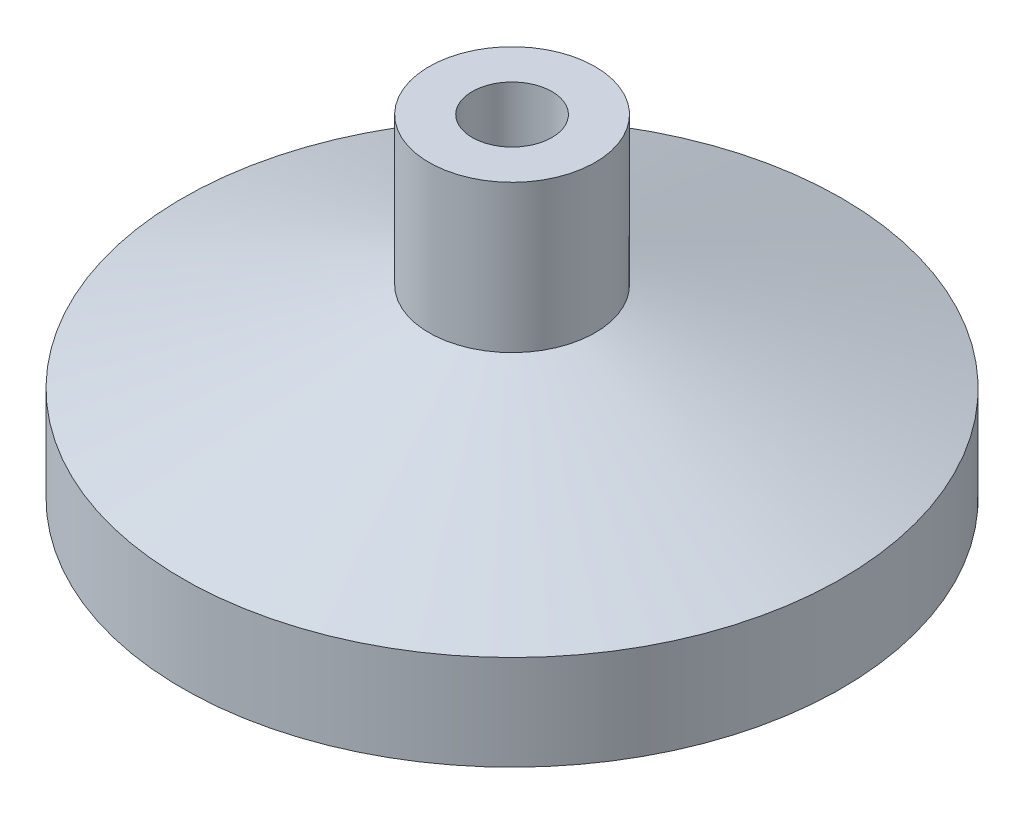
from build123d import *


with BuildPart() as part:
    # Sketch1 → Revolve1 (revolve)
    with BuildSketch(Plane.XY, mode=Mode.PRIVATE) as revolve1_sk:
        with BuildLine():
            Line((-1.524, 0.889), (-1.524, 12.7))
            Line((-1.524, 12.7), (-3.175, 12.7))
            Line((-3.175, 12.7), (-3.175, 7.062037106))
            Line((-3.175, 7.062037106), (-12.5984, 3.6322))
            Line((-12.5984, 3.6322), (-12.5984, 0))
            Line((-12.5984, 0), (-10.922, 0))
            Line((-10.922, 0), (-10.922, 1.3208))
            ThreePointArc((-10.922, 1.3208), (-10.433686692, 2.040621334), (-9.584339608, 1.852998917))
            Line((-9.584339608, 1.852998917), (-8.60238726, 0.889))
            Line((-8.60238726, 0.889), (-1.524, 0.889))
        make_face()
    revolve(revolve1_sk.sketch.rotate(Axis((0, 0, 0), (0, 1, 0)), 270), axis=Axis((0, 0, 0), (0, 1, 0)))


solid = part.part
